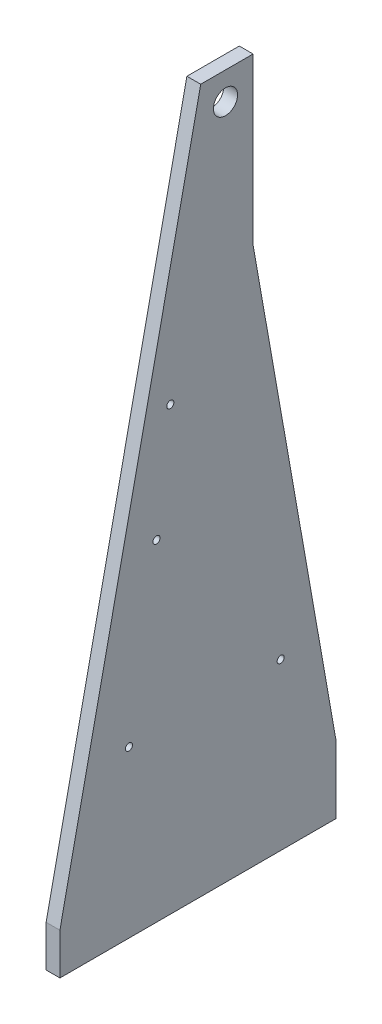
from build123d import *

# Parameters (mm, degrees)
BOSS_EXTRUDE1_DEPTH          = 12.7
F_7_8_0_875_DIAMETER_HOLE1_D = 22.225
F_1_4_CLEARANCE_HOLE1_D      = 6.5278
F_1_4_CLEARANCE_HOLE1_DEPTH  = 22.86
F_1_4_CLEARANCE_HOLE1_TIP    = 1.961148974
F_1_4_20_TAPPED_HOLE1_D      = 5.1054
F_1_4_20_TAPPED_HOLE1_DEPTH  = 13.335
F_1_4_20_TAPPED_HOLE1_TIP    = 1.533816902
FILLET1_R                    = 9.652


with BuildPart() as part:
    # Sketch1 → Boss-Extrude1 (new body)
    with BuildSketch(Plane(origin=(0, 0, 0), x_dir=(0, 0, -1), z_dir=(1, 0, 0))):
        Polygon((2.574479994, 647.7), (50.8, 647.7), (50.8, 495.3), (127, 63.148325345), (127, 0), (-127, 0), (-127, 38.1), align=None)
    extrude(amount=BOSS_EXTRUDE1_DEPTH)

    # 7_8 _0.875_ Diameter Hole1 (through all)
    with Locations(Plane(origin=(12.7, 0, 0), x_dir=(0, 0, -1), z_dir=(1, 0, 0))):
        with Locations((25.4, 622.3)):
            Hole(F_7_8_0_875_DIAMETER_HOLE1_D / 2)

    # 1_4 Clearance Hole1
    with Locations(Plane(origin=(12.7, 0, 0), x_dir=(0, 0, -1), z_dir=(1, 0, 0))):
        with Locations((-25.4, 406.4), (-38.1, 304.8), (-63.5, 152.4), (76.2, 152.4)):
            Hole(F_1_4_CLEARANCE_HOLE1_D / 2, depth=F_1_4_CLEARANCE_HOLE1_DEPTH)
            with Locations((0, 0, -(F_1_4_CLEARANCE_HOLE1_DEPTH + F_1_4_CLEARANCE_HOLE1_TIP / 2))):  # 118° drill point
                Cone(0, F_1_4_CLEARANCE_HOLE1_D / 2, F_1_4_CLEARANCE_HOLE1_TIP, mode=Mode.SUBTRACT)

    # 1_4-20 Tapped Hole1
    with Locations(Plane(origin=(0, 0, 0), x_dir=(-1, 0, 0), z_dir=(0, -1, 0))):
        with Locations((-6.35, 101.6), (-6.35, 50.8), (-6.35, 0), (-6.35, -50.8), (-6.35, -101.6)):
            Hole(F_1_4_20_TAPPED_HOLE1_D / 2, depth=F_1_4_20_TAPPED_HOLE1_DEPTH)
            with Locations((0, 0, -(F_1_4_20_TAPPED_HOLE1_DEPTH + F_1_4_20_TAPPED_HOLE1_TIP / 2))):  # 118° drill point
                Cone(0, F_1_4_20_TAPPED_HOLE1_D / 2, F_1_4_20_TAPPED_HOLE1_TIP, mode=Mode.SUBTRACT)

    # Fillet1
    fillet1_edges = [part.edges().sort_by_distance(p)[0] for p in [
        (6.35, 495.3, -50.8),
    ]]
    fillet(fillet1_edges, radius=FILLET1_R)


solid = part.part
